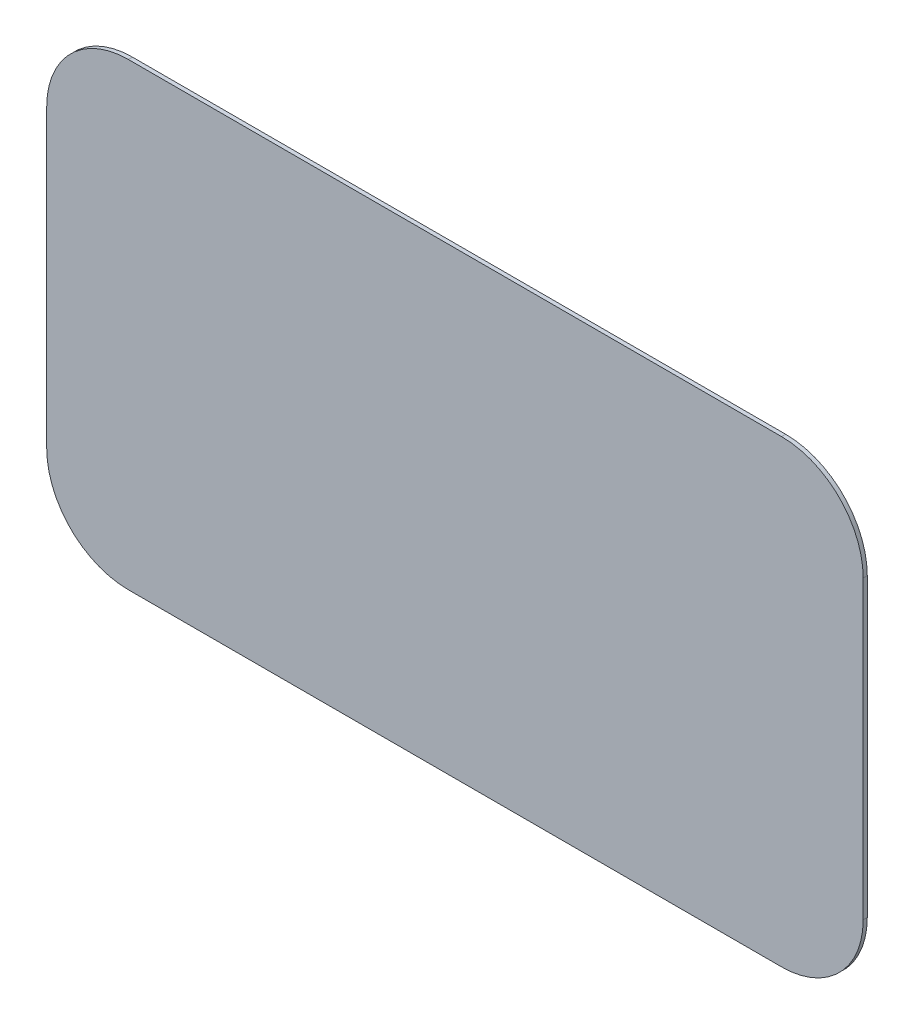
from build123d import *

# Parameters (mm, degrees)
SKETCH_1_W      = 20
SKETCH_1_H      = 11.25
EXTRUDE_1_DEPTH = 0.1
FILLET_1_R      = 2


with BuildPart() as part:
    # Sketch 1 → Extrude 1 (new body)
    with BuildSketch(Plane.XY):
        Rectangle(SKETCH_1_W, SKETCH_1_H)
    extrude(amount=EXTRUDE_1_DEPTH)

    # Fillet 1
    fillet_1_edges = [part.edges().sort_by_distance(p)[0] for p in [
        (10, -5.625, 0.05),
        (-10, -5.625, 0.05),
        (-10, 5.625, 0.05),
        (10, 5.625, 0.05),
    ]]
    fillet(fillet_1_edges, radius=FILLET_1_R)


solid = part.part
